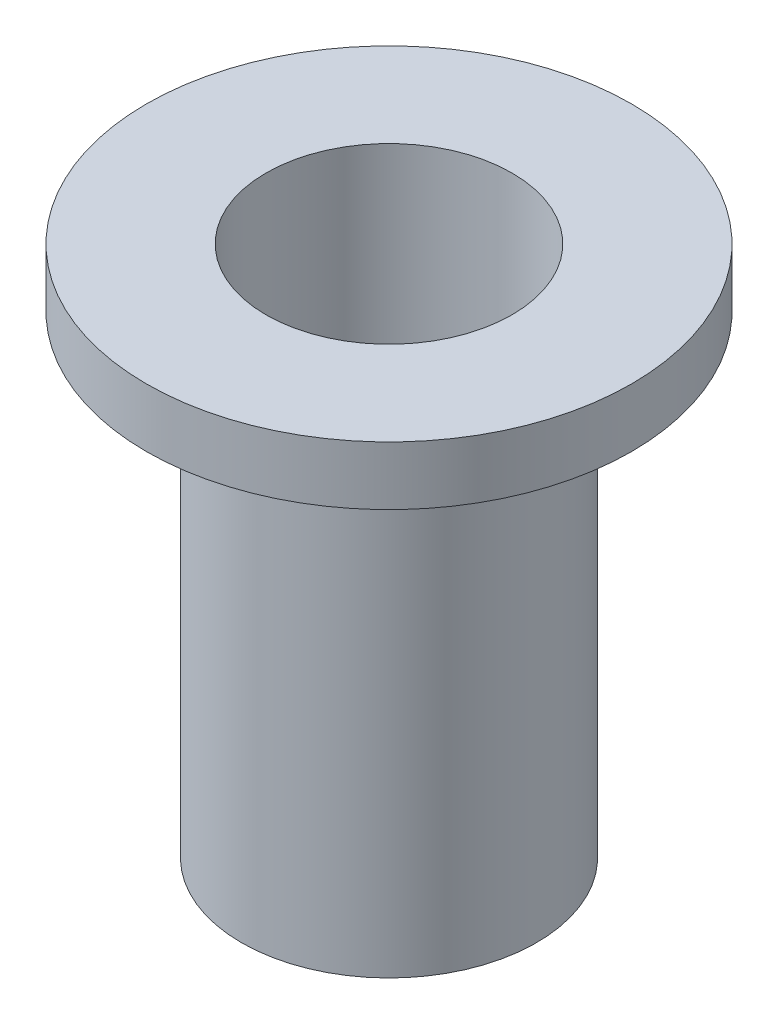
ISO-10303-21;
HEADER;
FILE_DESCRIPTION(('STEP AP214'),'2;1');
FILE_NAME('part.step','',(''),(''),'','','');
FILE_SCHEMA(('AUTOMOTIVE_DESIGN { 1 0 10303 214 1 1 1 1 }'));
ENDSEC;
DATA;
#1=APPLICATION_CONTEXT('core data for automotive mechanical design processes');
#2=APPLICATION_PROTOCOL_DEFINITION('international standard','automotive_design',2000,#1);
#3=PRODUCT_CONTEXT('',#1,'mechanical');
#4=PRODUCT('Part','Part','',(#3));
#5=PRODUCT_RELATED_PRODUCT_CATEGORY('part','',(#4));
#6=PRODUCT_DEFINITION_FORMATION('','',#4);
#7=PRODUCT_DEFINITION_CONTEXT('part definition',#1,'design');
#8=PRODUCT_DEFINITION('design','',#6,#7);
#9=PRODUCT_DEFINITION_SHAPE('','',#8);
#10=(LENGTH_UNIT() NAMED_UNIT(*) SI_UNIT(.MILLI.,.METRE.));
#11=(NAMED_UNIT(*) PLANE_ANGLE_UNIT() SI_UNIT($,.RADIAN.));
#12=(NAMED_UNIT(*) SI_UNIT($,.STERADIAN.) SOLID_ANGLE_UNIT());
#13=UNCERTAINTY_MEASURE_WITH_UNIT(LENGTH_MEASURE(1.E-05),#10,'distance_accuracy_value','');
#14=(GEOMETRIC_REPRESENTATION_CONTEXT(3) GLOBAL_UNCERTAINTY_ASSIGNED_CONTEXT((#13)) GLOBAL_UNIT_ASSIGNED_CONTEXT((#10,
#11,#12)) REPRESENTATION_CONTEXT('',''));
#15=CARTESIAN_POINT('',(0.,0.,0.));
#16=DIRECTION('',(0.,0.,1.));
#17=DIRECTION('',(1.,0.,0.));
#18=AXIS2_PLACEMENT_3D('',#15,#16,#17);
#19=CARTESIAN_POINT('',(-6.51509999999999,14.2748,0.));
#20=DIRECTION('',(0.,1.,0.));
#21=DIRECTION('',(0.,0.,1.));
#22=AXIS2_PLACEMENT_3D('',#19,#20,#21);
#23=PLANE('',#22);
#24=CARTESIAN_POINT('',(0.,14.2748,0.));
#25=DIRECTION('',(0.,1.,0.));
#26=DIRECTION('',(0.,0.,1.));
#27=AXIS2_PLACEMENT_3D('',#24,#25,#26);
#28=CIRCLE('',#27,6.51509999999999);
#29=CARTESIAN_POINT('',(0.,14.2748,6.51509999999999));
#30=VERTEX_POINT('',#29);
#31=EDGE_CURVE('E10',#30,#30,#28,.T.);
#32=ORIENTED_EDGE('',*,*,#31,.T.);
#33=EDGE_LOOP('',(#32));
#34=FACE_BOUND('',#33,.T.);
#35=CARTESIAN_POINT('',(0.,14.2748,0.));
#36=DIRECTION('',(0.,1.,0.));
#37=DIRECTION('',(0.,0.,1.));
#38=AXIS2_PLACEMENT_3D('',#35,#36,#37);
#39=CIRCLE('',#38,3.30199999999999);
#40=CARTESIAN_POINT('',(0.,14.2748,3.30199999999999));
#41=VERTEX_POINT('',#40);
#42=EDGE_CURVE('E52',#41,#41,#39,.T.);
#43=ORIENTED_EDGE('',*,*,#42,.F.);
#44=EDGE_LOOP('',(#43));
#45=FACE_BOUND('',#44,.T.);
#46=ADVANCED_FACE('F30',(#34,#45),#23,.T.);
#47=CARTESIAN_POINT('',(0.,63.9339407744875,0.));
#48=DIRECTION('',(0.,1.,0.));
#49=DIRECTION('',(0.,0.,1.));
#50=AXIS2_PLACEMENT_3D('',#47,#48,#49);
#51=CYLINDRICAL_SURFACE('',#50,6.51509999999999);
#52=CARTESIAN_POINT('',(0.,12.7,0.));
#53=DIRECTION('',(0.,1.,0.));
#54=DIRECTION('',(0.,0.,1.));
#55=AXIS2_PLACEMENT_3D('',#52,#53,#54);
#56=CIRCLE('',#55,6.51509999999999);
#57=CARTESIAN_POINT('',(0.,12.7,6.51509999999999));
#58=VERTEX_POINT('',#57);
#59=EDGE_CURVE('E36',#58,#58,#56,.T.);
#60=ORIENTED_EDGE('',*,*,#59,.T.);
#61=EDGE_LOOP('',(#60));
#62=FACE_BOUND('',#61,.T.);
#63=ORIENTED_EDGE('',*,*,#31,.F.);
#64=EDGE_LOOP('',(#63));
#65=FACE_BOUND('',#64,.T.);
#66=ADVANCED_FACE('F60',(#62,#65),#51,.T.);
#67=CARTESIAN_POINT('',(-3.96239999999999,12.7,0.));
#68=DIRECTION('',(0.,-1.,0.));
#69=DIRECTION('',(0.,0.,-1.));
#70=AXIS2_PLACEMENT_3D('',#67,#68,#69);
#71=PLANE('',#70);
#72=CARTESIAN_POINT('',(0.,12.7,0.));
#73=DIRECTION('',(0.,1.,0.));
#74=DIRECTION('',(0.,0.,1.));
#75=AXIS2_PLACEMENT_3D('',#72,#73,#74);
#76=CIRCLE('',#75,3.96239999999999);
#77=CARTESIAN_POINT('',(0.,12.7,3.96239999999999));
#78=VERTEX_POINT('',#77);
#79=EDGE_CURVE('E40',#78,#78,#76,.T.);
#80=ORIENTED_EDGE('',*,*,#79,.T.);
#81=EDGE_LOOP('',(#80));
#82=FACE_BOUND('',#81,.T.);
#83=ORIENTED_EDGE('',*,*,#59,.F.);
#84=EDGE_LOOP('',(#83));
#85=FACE_BOUND('',#84,.T.);
#86=ADVANCED_FACE('F64',(#82,#85),#71,.T.);
#87=CARTESIAN_POINT('',(0.,63.9339407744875,0.));
#88=DIRECTION('',(0.,1.,0.));
#89=DIRECTION('',(0.,0.,1.));
#90=AXIS2_PLACEMENT_3D('',#87,#88,#89);
#91=CYLINDRICAL_SURFACE('',#90,3.96239999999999);
#92=CARTESIAN_POINT('',(0.,0.,0.));
#93=DIRECTION('',(0.,1.,0.));
#94=DIRECTION('',(0.,0.,1.));
#95=AXIS2_PLACEMENT_3D('',#92,#93,#94);
#96=CIRCLE('',#95,3.96239999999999);
#97=CARTESIAN_POINT('',(0.,0.,3.96239999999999));
#98=VERTEX_POINT('',#97);
#99=EDGE_CURVE('E44',#98,#98,#96,.T.);
#100=ORIENTED_EDGE('',*,*,#99,.T.);
#101=EDGE_LOOP('',(#100));
#102=FACE_BOUND('',#101,.T.);
#103=ORIENTED_EDGE('',*,*,#79,.F.);
#104=EDGE_LOOP('',(#103));
#105=FACE_BOUND('',#104,.T.);
#106=ADVANCED_FACE('F68',(#102,#105),#91,.T.);
#107=CARTESIAN_POINT('',(-3.30199999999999,0.,0.));
#108=DIRECTION('',(0.,-1.,0.));
#109=DIRECTION('',(0.,0.,-1.));
#110=AXIS2_PLACEMENT_3D('',#107,#108,#109);
#111=PLANE('',#110);
#112=CARTESIAN_POINT('',(0.,0.,0.));
#113=DIRECTION('',(0.,1.,0.));
#114=DIRECTION('',(0.,0.,1.));
#115=AXIS2_PLACEMENT_3D('',#112,#113,#114);
#116=CIRCLE('',#115,3.30199999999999);
#117=CARTESIAN_POINT('',(0.,0.,3.30199999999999));
#118=VERTEX_POINT('',#117);
#119=EDGE_CURVE('E49',#118,#118,#116,.T.);
#120=ORIENTED_EDGE('',*,*,#119,.T.);
#121=EDGE_LOOP('',(#120));
#122=FACE_BOUND('',#121,.T.);
#123=ORIENTED_EDGE('',*,*,#99,.F.);
#124=EDGE_LOOP('',(#123));
#125=FACE_BOUND('',#124,.T.);
#126=ADVANCED_FACE('F75',(#122,#125),#111,.T.);
#127=CARTESIAN_POINT('',(0.,63.9339407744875,0.));
#128=DIRECTION('',(0.,1.,0.));
#129=DIRECTION('',(0.,0.,1.));
#130=AXIS2_PLACEMENT_3D('',#127,#128,#129);
#131=CYLINDRICAL_SURFACE('',#130,3.30199999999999);
#132=ORIENTED_EDGE('',*,*,#42,.T.);
#133=EDGE_LOOP('',(#132));
#134=FACE_BOUND('',#133,.T.);
#135=ORIENTED_EDGE('',*,*,#119,.F.);
#136=EDGE_LOOP('',(#135));
#137=FACE_BOUND('',#136,.T.);
#138=ADVANCED_FACE('F56',(#134,#137),#131,.F.);
#139=CLOSED_SHELL('',(#46,#66,#86,#106,#126,#138));
#140=MANIFOLD_SOLID_BREP('B2',#139);
#141=ADVANCED_BREP_SHAPE_REPRESENTATION('',(#18,#140),#14);
#142=SHAPE_DEFINITION_REPRESENTATION(#9,#141);
ENDSEC;
END-ISO-10303-21;
